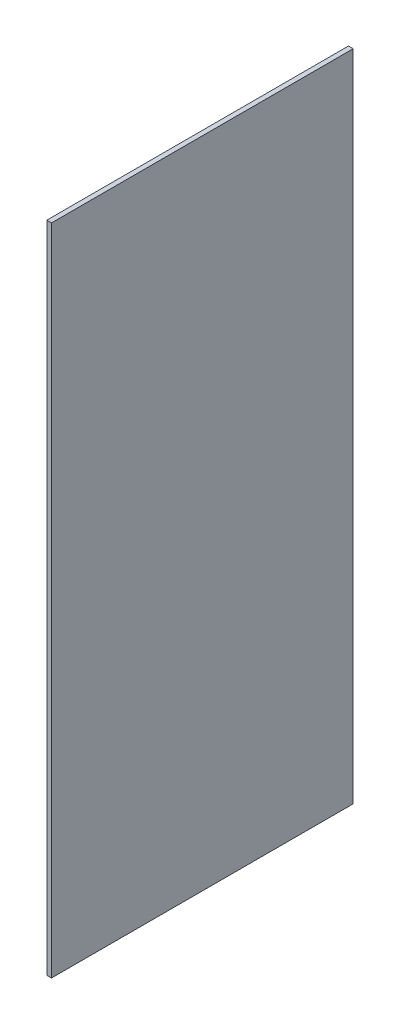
from build123d import *

# Parameters (mm, degrees)
SKETCH1_W           = 9.525
SKETCH1_H           = 609.6
BOSS_EXTRUDE1_DEPTH = 1321.48771151


with BuildPart() as part:
    # Sketch1 → Boss-Extrude1 (new body)
    with BuildSketch(Plane(origin=(0, 0, 0), x_dir=(-1, 0, 0), z_dir=(0, 1, 0))):
        Rectangle(SKETCH1_W, SKETCH1_H)
    extrude(amount=BOSS_EXTRUDE1_DEPTH)


solid = part.part
